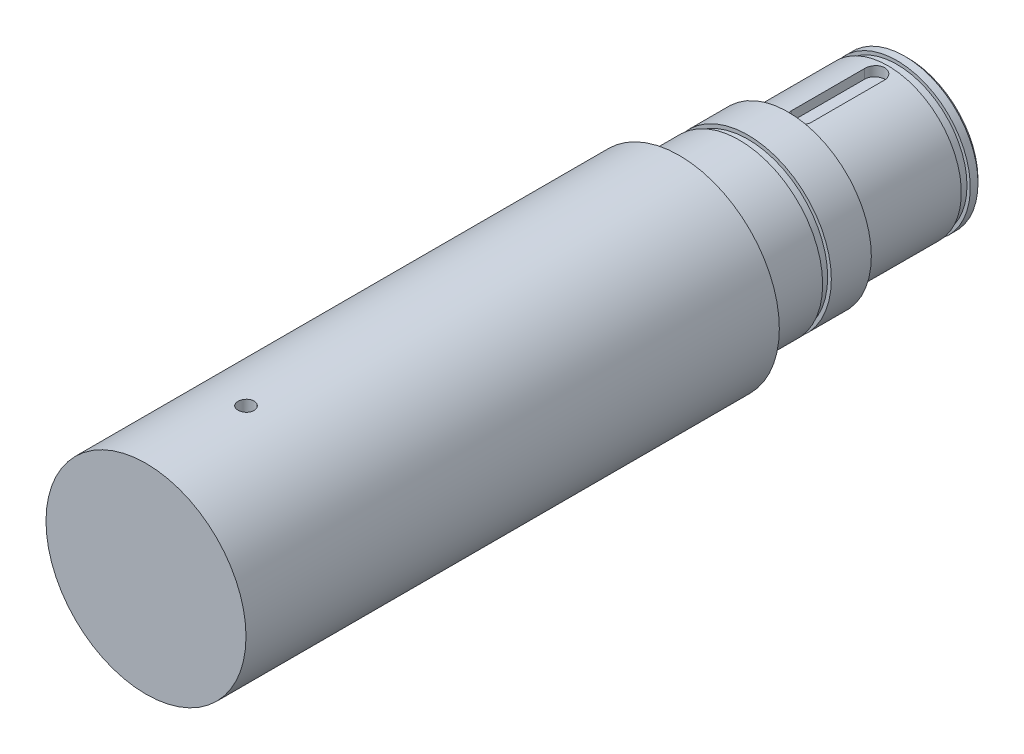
ISO-10303-21;
HEADER;
FILE_DESCRIPTION(('STEP AP214'),'2;1');
FILE_NAME('part.step','',(''),(''),'','','');
FILE_SCHEMA(('AUTOMOTIVE_DESIGN { 1 0 10303 214 1 1 1 1 }'));
ENDSEC;
DATA;
#1=APPLICATION_CONTEXT('core data for automotive mechanical design processes');
#2=APPLICATION_PROTOCOL_DEFINITION('international standard','automotive_design',2000,#1);
#3=PRODUCT_CONTEXT('',#1,'mechanical');
#4=PRODUCT('Part','Part','',(#3));
#5=PRODUCT_RELATED_PRODUCT_CATEGORY('part','',(#4));
#6=PRODUCT_DEFINITION_FORMATION('','',#4);
#7=PRODUCT_DEFINITION_CONTEXT('part definition',#1,'design');
#8=PRODUCT_DEFINITION('design','',#6,#7);
#9=PRODUCT_DEFINITION_SHAPE('','',#8);
#10=(LENGTH_UNIT() NAMED_UNIT(*) SI_UNIT(.MILLI.,.METRE.));
#11=(NAMED_UNIT(*) PLANE_ANGLE_UNIT() SI_UNIT($,.RADIAN.));
#12=(NAMED_UNIT(*) SI_UNIT($,.STERADIAN.) SOLID_ANGLE_UNIT());
#13=UNCERTAINTY_MEASURE_WITH_UNIT(LENGTH_MEASURE(1.E-05),#10,'distance_accuracy_value','');
#14=(GEOMETRIC_REPRESENTATION_CONTEXT(3) GLOBAL_UNCERTAINTY_ASSIGNED_CONTEXT((#13)) GLOBAL_UNIT_ASSIGNED_CONTEXT((#10,
#11,#12)) REPRESENTATION_CONTEXT('',''));
#15=CARTESIAN_POINT('',(0.,0.,0.));
#16=DIRECTION('',(0.,0.,1.));
#17=DIRECTION('',(1.,0.,0.));
#18=AXIS2_PLACEMENT_3D('',#15,#16,#17);
#19=CARTESIAN_POINT('',(0.,0.,18.));
#20=DIRECTION('',(0.,0.,-1.));
#21=DIRECTION('',(-1.,0.,0.));
#22=AXIS2_PLACEMENT_3D('',#19,#20,#21);
#23=CYLINDRICAL_SURFACE('',#22,11.);
#24=DIRECTION('',(0.,0.,-1.));
#25=VECTOR('',#24,1.);
#26=CARTESIAN_POINT('',(-1.5,10.8972473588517,18.));
#27=LINE('',#26,#25);
#28=CARTESIAN_POINT('',(-1.5,10.8972473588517,16.));
#29=VERTEX_POINT('',#28);
#30=CARTESIAN_POINT('',(-1.5,10.8972473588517,5.));
#31=VERTEX_POINT('',#30);
#32=EDGE_CURVE('E45',#29,#31,#27,.T.);
#33=ORIENTED_EDGE('',*,*,#32,.T.);
#34=CARTESIAN_POINT('',(-1.5,10.8972473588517,5.));
#35=CARTESIAN_POINT('',(-1.49999995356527,10.8972459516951,4.958007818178));
#36=CARTESIAN_POINT('',(-1.49823554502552,10.8974903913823,4.91603594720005));
#37=CARTESIAN_POINT('',(-1.49119813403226,10.8984561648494,4.83239641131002));
#38=CARTESIAN_POINT('',(-1.48592542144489,10.8991774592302,4.79072872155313));
#39=CARTESIAN_POINT('',(-1.46490229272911,10.9020307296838,4.66673026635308));
#40=CARTESIAN_POINT('',(-1.44394670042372,10.9048522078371,4.58523622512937));
#41=CARTESIAN_POINT('',(-1.3887651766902,10.9120161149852,4.4269665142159));
#42=CARTESIAN_POINT('',(-1.3545352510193,10.9163590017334,4.35019227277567));
#43=CARTESIAN_POINT('',(-1.27379205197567,10.9260743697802,4.20346904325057));
#44=CARTESIAN_POINT('',(-1.22727946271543,10.9314467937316,4.13351967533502));
#45=CARTESIAN_POINT('',(-1.12296889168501,10.942655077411,4.00198765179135));
#46=CARTESIAN_POINT('',(-1.06510669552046,10.9484934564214,3.94045615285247));
#47=CARTESIAN_POINT('',(-0.939870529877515,10.9599539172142,3.82793762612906));
#48=CARTESIAN_POINT('',(-0.872495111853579,10.9655759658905,3.77695220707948));
#49=CARTESIAN_POINT('',(-0.729821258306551,10.9759960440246,3.68679418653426));
#50=CARTESIAN_POINT('',(-0.654492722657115,10.9807907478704,3.64766880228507));
#51=CARTESIAN_POINT('',(-0.498262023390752,10.9889875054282,3.58264592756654));
#52=CARTESIAN_POINT('',(-0.417360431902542,10.9923897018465,3.55674708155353));
#53=CARTESIAN_POINT('',(-0.252808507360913,10.9974005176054,3.51906519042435));
#54=CARTESIAN_POINT('',(-0.169178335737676,10.9990201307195,3.50719558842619));
#55=CARTESIAN_POINT('',(-0.00109655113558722,11.0003209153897,3.49764056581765));
#56=CARTESIAN_POINT('',(0.0833550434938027,11.0000021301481,3.49995482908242));
#57=CARTESIAN_POINT('',(0.250088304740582,10.9974708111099,3.51863345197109));
#58=CARTESIAN_POINT('',(0.332380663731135,10.9952708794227,3.53490431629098));
#59=CARTESIAN_POINT('',(0.493055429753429,10.9892385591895,3.58088777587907));
#60=CARTESIAN_POINT('',(0.571437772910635,10.9854061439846,3.61060059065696));
#61=CARTESIAN_POINT('',(0.722356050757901,10.9765176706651,3.68272292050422));
#62=CARTESIAN_POINT('',(0.794872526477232,10.9714577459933,3.72517265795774));
#63=CARTESIAN_POINT('',(0.931784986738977,10.9606797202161,3.82153285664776));
#64=CARTESIAN_POINT('',(0.996180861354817,10.9549616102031,3.87544347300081));
#65=CARTESIAN_POINT('',(1.1155695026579,10.9434518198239,3.99370907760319));
#66=CARTESIAN_POINT('',(1.17048285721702,10.9376599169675,4.05814423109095));
#67=CARTESIAN_POINT('',(1.26874438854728,10.92669853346,4.19538205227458));
#68=CARTESIAN_POINT('',(1.31208916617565,10.9215292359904,4.26818717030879));
#69=CARTESIAN_POINT('',(1.38598979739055,10.9123978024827,4.42018409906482));
#70=CARTESIAN_POINT('',(1.41653093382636,10.9084370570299,4.49938313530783));
#71=CARTESIAN_POINT('',(1.46381257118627,10.9021938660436,4.661795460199));
#72=CARTESIAN_POINT('',(1.48057381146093,10.8999088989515,4.74500251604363));
#73=CARTESIAN_POINT('',(1.49347688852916,10.8981434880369,4.85734730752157));
#74=CARTESIAN_POINT('',(1.49592418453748,10.897807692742,4.88584719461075));
#75=CARTESIAN_POINT('',(1.49918356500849,10.8973598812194,4.94289399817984));
#76=CARTESIAN_POINT('',(1.49999839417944,10.8972474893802,4.97144075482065));
#77=CARTESIAN_POINT('',(1.5,10.8972473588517,5.));
#78=B_SPLINE_CURVE_WITH_KNOTS('',3,(#34,#35,#36,#37,#38,#39,#40,#41,#42,#43,#44,#45,#46,#47,#48,
#49,#50,#51,#52,#53,#54,#55,#56,#57,#58,#59,#60,#61,#62,#63,#64,#65,#66,#67,#68,#69,#70,#71,#72,
#73,#74,#75,#76,#77),.UNSPECIFIED.,.F.,.F.,(4,2,2,2,2,2,2,2,2,2,2,2,2,2,2,2,2,2,2,2,2,4),(0.,
0.125898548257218,0.251786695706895,0.503065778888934,0.754420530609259,1.00576128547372,
1.25856739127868,1.51141203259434,1.76525046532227,2.01906287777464,2.2713010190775,
2.52353353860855,2.77408943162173,3.0246494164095,3.27600913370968,3.52737225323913,
3.78074786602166,4.03419784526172,4.28793835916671,4.54129627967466,4.62708158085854,
4.71272252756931),.UNSPECIFIED.);
#79=CARTESIAN_POINT('',(1.5,10.8972473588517,5.));
#80=VERTEX_POINT('',#79);
#81=EDGE_CURVE('E154',#31,#80,#78,.T.);
#82=ORIENTED_EDGE('',*,*,#81,.T.);
#83=DIRECTION('',(0.,0.,-1.));
#84=VECTOR('',#83,1.);
#85=CARTESIAN_POINT('',(1.5,10.8972473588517,18.));
#86=LINE('',#85,#84);
#87=CARTESIAN_POINT('',(1.5,10.8972473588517,16.));
#88=VERTEX_POINT('',#87);
#89=EDGE_CURVE('E379',#80,#88,#86,.F.);
#90=ORIENTED_EDGE('',*,*,#89,.T.);
#91=CARTESIAN_POINT('',(1.5,10.8972473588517,16.));
#92=CARTESIAN_POINT('',(1.49999995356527,10.8972459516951,16.041992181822));
#93=CARTESIAN_POINT('',(1.49823554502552,10.8974903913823,16.0839640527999));
#94=CARTESIAN_POINT('',(1.49119813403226,10.8984561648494,16.16760358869));
#95=CARTESIAN_POINT('',(1.48592542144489,10.8991774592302,16.2092712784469));
#96=CARTESIAN_POINT('',(1.46490229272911,10.9020307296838,16.3332697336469));
#97=CARTESIAN_POINT('',(1.44394670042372,10.9048522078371,16.4147637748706));
#98=CARTESIAN_POINT('',(1.3887651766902,10.9120161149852,16.5730334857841));
#99=CARTESIAN_POINT('',(1.3545352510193,10.9163590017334,16.6498077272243));
#100=CARTESIAN_POINT('',(1.27379205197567,10.9260743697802,16.7965309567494));
#101=CARTESIAN_POINT('',(1.22727946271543,10.9314467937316,16.866480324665));
#102=CARTESIAN_POINT('',(1.12296889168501,10.942655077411,16.9980123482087));
#103=CARTESIAN_POINT('',(1.06510669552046,10.9484934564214,17.0595438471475));
#104=CARTESIAN_POINT('',(0.939870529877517,10.9599539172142,17.1720623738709));
#105=CARTESIAN_POINT('',(0.872495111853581,10.9655759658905,17.2230477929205));
#106=CARTESIAN_POINT('',(0.729821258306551,10.9759960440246,17.3132058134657));
#107=CARTESIAN_POINT('',(0.654492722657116,10.9807907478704,17.3523311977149));
#108=CARTESIAN_POINT('',(0.498262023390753,10.9889875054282,17.4173540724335));
#109=CARTESIAN_POINT('',(0.417360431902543,10.9923897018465,17.4432529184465));
#110=CARTESIAN_POINT('',(0.252808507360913,10.9974005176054,17.4809348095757));
#111=CARTESIAN_POINT('',(0.169178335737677,10.9990201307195,17.4928044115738));
#112=CARTESIAN_POINT('',(0.00109655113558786,11.0003209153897,17.5023594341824));
#113=CARTESIAN_POINT('',(-0.0833550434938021,11.0000021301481,17.5000451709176));
#114=CARTESIAN_POINT('',(-0.250088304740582,10.9974708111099,17.4813665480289));
#115=CARTESIAN_POINT('',(-0.332380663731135,10.9952708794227,17.465095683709));
#116=CARTESIAN_POINT('',(-0.493055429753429,10.9892385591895,17.4191122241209));
#117=CARTESIAN_POINT('',(-0.571437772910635,10.9854061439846,17.389399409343));
#118=CARTESIAN_POINT('',(-0.722356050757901,10.9765176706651,17.3172770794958));
#119=CARTESIAN_POINT('',(-0.794872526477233,10.9714577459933,17.2748273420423));
#120=CARTESIAN_POINT('',(-0.931784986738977,10.9606797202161,17.1784671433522));
#121=CARTESIAN_POINT('',(-0.996180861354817,10.9549616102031,17.1245565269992));
#122=CARTESIAN_POINT('',(-1.1155695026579,10.9434518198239,17.0062909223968));
#123=CARTESIAN_POINT('',(-1.17048285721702,10.9376599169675,16.9418557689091));
#124=CARTESIAN_POINT('',(-1.26874438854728,10.92669853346,16.8046179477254));
#125=CARTESIAN_POINT('',(-1.31208916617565,10.9215292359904,16.7318128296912));
#126=CARTESIAN_POINT('',(-1.38598979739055,10.9123978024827,16.5798159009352));
#127=CARTESIAN_POINT('',(-1.41653093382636,10.9084370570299,16.5006168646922));
#128=CARTESIAN_POINT('',(-1.46381257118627,10.9021938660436,16.338204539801));
#129=CARTESIAN_POINT('',(-1.48057381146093,10.8999088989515,16.2549974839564));
#130=CARTESIAN_POINT('',(-1.49347688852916,10.8981434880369,16.1426526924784));
#131=CARTESIAN_POINT('',(-1.49592418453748,10.897807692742,16.1141528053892));
#132=CARTESIAN_POINT('',(-1.49918356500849,10.8973598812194,16.0571060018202));
#133=CARTESIAN_POINT('',(-1.49999839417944,10.8972474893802,16.0285592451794));
#134=CARTESIAN_POINT('',(-1.5,10.8972473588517,16.));
#135=B_SPLINE_CURVE_WITH_KNOTS('',3,(#91,#92,#93,#94,#95,#96,#97,#98,#99,#100,#101,#102,#103,
#104,#105,#106,#107,#108,#109,#110,#111,#112,#113,#114,#115,#116,#117,#118,#119,#120,#121,#122,
#123,#124,#125,#126,#127,#128,#129,#130,#131,#132,#133,#134),.UNSPECIFIED.,.F.,.F.,(4,2,2,2,2,2,
2,2,2,2,2,2,2,2,2,2,2,2,2,2,2,4),(0.,0.125898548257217,0.251786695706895,0.503065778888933,
0.754420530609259,1.00576128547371,1.25856739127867,1.51141203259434,1.76525046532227,
2.01906287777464,2.27130101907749,2.52353353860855,2.77408943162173,3.0246494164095,
3.27600913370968,3.52737225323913,3.78074786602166,4.03419784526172,4.28793835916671,
4.54129627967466,4.62708158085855,4.71272252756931),.UNSPECIFIED.);
#136=EDGE_CURVE('E52',#88,#29,#135,.T.);
#137=ORIENTED_EDGE('',*,*,#136,.T.);
#138=EDGE_LOOP('',(#33,#82,#90,#137));
#139=FACE_BOUND('',#138,.T.);
#140=CARTESIAN_POINT('',(0.,0.,18.));
#141=DIRECTION('',(0.,0.,1.));
#142=DIRECTION('',(1.,0.,0.));
#143=AXIS2_PLACEMENT_3D('',#140,#141,#142);
#144=CIRCLE('',#143,11.);
#145=CARTESIAN_POINT('',(11.,0.,18.));
#146=VERTEX_POINT('',#145);
#147=EDGE_CURVE('E139',#146,#146,#144,.T.);
#148=ORIENTED_EDGE('',*,*,#147,.F.);
#149=EDGE_LOOP('',(#148));
#150=FACE_BOUND('',#149,.T.);
#151=CARTESIAN_POINT('',(0.,0.,3.));
#152=DIRECTION('',(0.,0.,-1.));
#153=DIRECTION('',(-1.,0.,0.));
#154=AXIS2_PLACEMENT_3D('',#151,#152,#153);
#155=CIRCLE('',#154,11.);
#156=CARTESIAN_POINT('',(-11.,0.,3.));
#157=VERTEX_POINT('',#156);
#158=EDGE_CURVE('E113',#157,#157,#155,.T.);
#159=ORIENTED_EDGE('',*,*,#158,.F.);
#160=EDGE_LOOP('',(#159));
#161=FACE_BOUND('',#160,.T.);
#162=ADVANCED_FACE('F33',(#139,#150,#161),#23,.T.);
#163=CARTESIAN_POINT('',(0.,0.,24.));
#164=DIRECTION('',(0.,0.,1.));
#165=DIRECTION('',(1.,0.,0.));
#166=AXIS2_PLACEMENT_3D('',#163,#164,#165);
#167=PLANE('',#166);
#168=CARTESIAN_POINT('',(0.,0.,24.));
#169=DIRECTION('',(0.,0.,1.));
#170=DIRECTION('',(1.,0.,0.));
#171=AXIS2_PLACEMENT_3D('',#168,#169,#170);
#172=CIRCLE('',#171,12.5);
#173=CARTESIAN_POINT('',(12.5,0.,24.));
#174=VERTEX_POINT('',#173);
#175=EDGE_CURVE('E136',#174,#174,#172,.T.);
#176=ORIENTED_EDGE('',*,*,#175,.T.);
#177=EDGE_LOOP('',(#176));
#178=FACE_BOUND('',#177,.T.);
#179=CARTESIAN_POINT('',(0.,0.,24.));
#180=DIRECTION('',(0.,0.,1.));
#181=DIRECTION('',(1.,0.,0.));
#182=AXIS2_PLACEMENT_3D('',#179,#180,#181);
#183=CIRCLE('',#182,11.95);
#184=CARTESIAN_POINT('',(11.95,0.,24.));
#185=VERTEX_POINT('',#184);
#186=EDGE_CURVE('E127',#185,#185,#183,.T.);
#187=ORIENTED_EDGE('',*,*,#186,.F.);
#188=EDGE_LOOP('',(#187));
#189=FACE_BOUND('',#188,.T.);
#190=ADVANCED_FACE('F222',(#178,#189),#167,.T.);
#191=CARTESIAN_POINT('',(0.,0.,18.));
#192=DIRECTION('',(0.,0.,1.));
#193=DIRECTION('',(1.,0.,0.));
#194=AXIS2_PLACEMENT_3D('',#191,#192,#193);
#195=PLANE('',#194);
#196=CARTESIAN_POINT('',(0.,0.,18.));
#197=DIRECTION('',(0.,0.,1.));
#198=DIRECTION('',(1.,0.,0.));
#199=AXIS2_PLACEMENT_3D('',#196,#197,#198);
#200=CIRCLE('',#199,12.5);
#201=CARTESIAN_POINT('',(12.5,0.,18.));
#202=VERTEX_POINT('',#201);
#203=EDGE_CURVE('E133',#202,#202,#200,.T.);
#204=ORIENTED_EDGE('',*,*,#203,.F.);
#205=EDGE_LOOP('',(#204));
#206=FACE_BOUND('',#205,.T.);
#207=ORIENTED_EDGE('',*,*,#147,.T.);
#208=EDGE_LOOP('',(#207));
#209=FACE_BOUND('',#208,.T.);
#210=ADVANCED_FACE('F227',(#206,#209),#195,.F.);
#211=CARTESIAN_POINT('',(0.,0.,24.));
#212=DIRECTION('',(0.,0.,-1.));
#213=DIRECTION('',(-1.,0.,0.));
#214=AXIS2_PLACEMENT_3D('',#211,#212,#213);
#215=CYLINDRICAL_SURFACE('',#214,12.5);
#216=ORIENTED_EDGE('',*,*,#175,.F.);
#217=EDGE_LOOP('',(#216));
#218=FACE_BOUND('',#217,.T.);
#219=ORIENTED_EDGE('',*,*,#203,.T.);
#220=EDGE_LOOP('',(#219));
#221=FACE_BOUND('',#220,.T.);
#222=ADVANCED_FACE('F247',(#218,#221),#215,.T.);
#223=CARTESIAN_POINT('',(0.,0.,25.3));
#224=DIRECTION('',(0.,0.,-1.));
#225=DIRECTION('',(-1.,0.,0.));
#226=AXIS2_PLACEMENT_3D('',#223,#224,#225);
#227=CYLINDRICAL_SURFACE('',#226,11.95);
#228=CARTESIAN_POINT('',(0.,0.,25.3));
#229=DIRECTION('',(0.,0.,1.));
#230=DIRECTION('',(1.,0.,0.));
#231=AXIS2_PLACEMENT_3D('',#228,#229,#230);
#232=CIRCLE('',#231,11.95);
#233=CARTESIAN_POINT('',(11.95,0.,25.3));
#234=VERTEX_POINT('',#233);
#235=EDGE_CURVE('E130',#234,#234,#232,.T.);
#236=ORIENTED_EDGE('',*,*,#235,.F.);
#237=EDGE_LOOP('',(#236));
#238=FACE_BOUND('',#237,.T.);
#239=ORIENTED_EDGE('',*,*,#186,.T.);
#240=EDGE_LOOP('',(#239));
#241=FACE_BOUND('',#240,.T.);
#242=ADVANCED_FACE('F250',(#238,#241),#227,.T.);
#243=CARTESIAN_POINT('',(0.,0.,25.3));
#244=DIRECTION('',(0.,0.,1.));
#245=DIRECTION('',(1.,0.,0.));
#246=AXIS2_PLACEMENT_3D('',#243,#244,#245);
#247=PLANE('',#246);
#248=CARTESIAN_POINT('',(0.,0.,25.3));
#249=DIRECTION('',(0.,0.,1.));
#250=DIRECTION('',(1.,0.,0.));
#251=AXIS2_PLACEMENT_3D('',#248,#249,#250);
#252=CIRCLE('',#251,12.5);
#253=CARTESIAN_POINT('',(12.5,0.,25.3));
#254=VERTEX_POINT('',#253);
#255=EDGE_CURVE('E119',#254,#254,#252,.T.);
#256=ORIENTED_EDGE('',*,*,#255,.F.);
#257=EDGE_LOOP('',(#256));
#258=FACE_BOUND('',#257,.T.);
#259=ORIENTED_EDGE('',*,*,#235,.T.);
#260=EDGE_LOOP('',(#259));
#261=FACE_BOUND('',#260,.T.);
#262=ADVANCED_FACE('F207',(#258,#261),#247,.F.);
#263=CARTESIAN_POINT('',(0.,0.,34.3));
#264=DIRECTION('',(0.,0.,-1.));
#265=DIRECTION('',(-1.,0.,0.));
#266=AXIS2_PLACEMENT_3D('',#263,#264,#265);
#267=CYLINDRICAL_SURFACE('',#266,12.5);
#268=CARTESIAN_POINT('',(0.,0.,34.3));
#269=DIRECTION('',(0.,0.,1.));
#270=DIRECTION('',(1.,0.,0.));
#271=AXIS2_PLACEMENT_3D('',#268,#269,#270);
#272=CIRCLE('',#271,12.5);
#273=CARTESIAN_POINT('',(12.5,0.,34.3));
#274=VERTEX_POINT('',#273);
#275=EDGE_CURVE('E124',#274,#274,#272,.T.);
#276=ORIENTED_EDGE('',*,*,#275,.F.);
#277=EDGE_LOOP('',(#276));
#278=FACE_BOUND('',#277,.T.);
#279=ORIENTED_EDGE('',*,*,#255,.T.);
#280=EDGE_LOOP('',(#279));
#281=FACE_BOUND('',#280,.T.);
#282=ADVANCED_FACE('F201',(#278,#281),#267,.T.);
#283=CARTESIAN_POINT('',(0.,0.,34.3));
#284=DIRECTION('',(0.,0.,1.));
#285=DIRECTION('',(1.,0.,0.));
#286=AXIS2_PLACEMENT_3D('',#283,#284,#285);
#287=PLANE('',#286);
#288=CARTESIAN_POINT('',(0.,0.,34.3));
#289=DIRECTION('',(0.,0.,1.));
#290=DIRECTION('',(1.,0.,0.));
#291=AXIS2_PLACEMENT_3D('',#288,#289,#290);
#292=CIRCLE('',#291,15.);
#293=CARTESIAN_POINT('',(15.,0.,34.3));
#294=VERTEX_POINT('',#293);
#295=EDGE_CURVE('E120',#294,#294,#292,.T.);
#296=ORIENTED_EDGE('',*,*,#295,.F.);
#297=EDGE_LOOP('',(#296));
#298=FACE_BOUND('',#297,.T.);
#299=ORIENTED_EDGE('',*,*,#275,.T.);
#300=EDGE_LOOP('',(#299));
#301=FACE_BOUND('',#300,.T.);
#302=ADVANCED_FACE('F199',(#298,#301),#287,.F.);
#303=CARTESIAN_POINT('',(0.,0.,114.3));
#304=DIRECTION('',(0.,0.,-1.));
#305=DIRECTION('',(-1.,0.,0.));
#306=AXIS2_PLACEMENT_3D('',#303,#304,#305);
#307=CYLINDRICAL_SURFACE('',#306,15.);
#308=CARTESIAN_POINT('',(0.,15.,100.5));
#309=CARTESIAN_POINT('',(-0.0672891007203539,14.9999993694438,100.499997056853));
#310=CARTESIAN_POINT('',(-0.134624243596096,14.9995423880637,100.494321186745));
#311=CARTESIAN_POINT('',(-0.267432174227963,14.9977633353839,100.471762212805));
#312=CARTESIAN_POINT('',(-0.332902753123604,14.9964402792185,100.454866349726));
#313=CARTESIAN_POINT('',(-0.460038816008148,14.9930786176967,100.410358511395));
#314=CARTESIAN_POINT('',(-0.521706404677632,14.991040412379,100.382752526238));
#315=CARTESIAN_POINT('',(-0.639517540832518,14.9864771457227,100.317618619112));
#316=CARTESIAN_POINT('',(-0.695662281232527,14.9839521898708,100.280092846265));
#317=CARTESIAN_POINT('',(-0.800981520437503,14.9786921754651,100.196088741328));
#318=CARTESIAN_POINT('',(-0.850141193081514,14.975956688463,100.149591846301));
#319=CARTESIAN_POINT('',(-0.939967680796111,14.9705875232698,100.049004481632));
#320=CARTESIAN_POINT('',(-0.980634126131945,14.9679538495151,99.9949136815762));
#321=CARTESIAN_POINT('',(-1.05236939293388,14.9630818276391,99.8805849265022));
#322=CARTESIAN_POINT('',(-1.08342527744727,14.9608440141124,99.8203388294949));
#323=CARTESIAN_POINT('',(-1.13497520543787,14.9570218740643,99.6954664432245));
#324=CARTESIAN_POINT('',(-1.15546942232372,14.9554375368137,99.6308402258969));
#325=CARTESIAN_POINT('',(-1.18527149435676,14.9531052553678,99.4991899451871));
#326=CARTESIAN_POINT('',(-1.19460338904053,14.9523555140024,99.4321713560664));
#327=CARTESIAN_POINT('',(-1.20189017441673,14.9517716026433,99.2975151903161));
#328=CARTESIAN_POINT('',(-1.19984526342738,14.9519374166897,99.2298776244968));
#329=CARTESIAN_POINT('',(-1.18445636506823,14.9531642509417,99.0960680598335));
#330=CARTESIAN_POINT('',(-1.1711384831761,14.9542232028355,99.029893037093));
#331=CARTESIAN_POINT('',(-1.13362223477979,14.9571137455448,98.9007206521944));
#332=CARTESIAN_POINT('',(-1.10942376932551,14.9589453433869,98.8377233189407));
#333=CARTESIAN_POINT('',(-1.05080395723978,14.9631771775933,98.7166112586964));
#334=CARTESIAN_POINT('',(-1.01637087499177,14.9655780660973,98.6585022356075));
#335=CARTESIAN_POINT('',(-0.93826772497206,14.9706773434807,98.5488786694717));
#336=CARTESIAN_POINT('',(-0.894597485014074,14.9733757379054,98.4973642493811));
#337=CARTESIAN_POINT('',(-0.799113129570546,14.9787751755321,98.4022403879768));
#338=CARTESIAN_POINT('',(-0.747276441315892,14.9814762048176,98.35865360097));
#339=CARTESIAN_POINT('',(-0.637009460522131,14.986569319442,98.2807973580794));
#340=CARTESIAN_POINT('',(-0.578579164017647,14.9889614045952,98.246527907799));
#341=CARTESIAN_POINT('',(-0.456769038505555,14.9931675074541,98.1882806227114));
#342=CARTESIAN_POINT('',(-0.393388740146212,14.9949814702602,98.164303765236));
#343=CARTESIAN_POINT('',(-0.263484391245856,14.9978262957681,98.1273380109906));
#344=CARTESIAN_POINT('',(-0.196960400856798,14.9988571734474,98.1143489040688));
#345=CARTESIAN_POINT('',(-0.0628534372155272,15.0000177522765,98.0997557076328));
#346=CARTESIAN_POINT('',(0.0047261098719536,15.0001499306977,98.0981203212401));
#347=CARTESIAN_POINT('',(0.139198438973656,14.9995048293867,98.1061990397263));
#348=CARTESIAN_POINT('',(0.206091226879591,14.9987275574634,98.1159130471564));
#349=CARTESIAN_POINT('',(0.337202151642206,14.9963525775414,98.1463888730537));
#350=CARTESIAN_POINT('',(0.401423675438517,14.9947559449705,98.167136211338));
#351=CARTESIAN_POINT('',(0.525473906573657,14.9909216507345,98.2190749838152));
#352=CARTESIAN_POINT('',(0.585302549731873,14.9886839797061,98.2502665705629));
#353=CARTESIAN_POINT('',(0.699011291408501,14.9838123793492,98.3222872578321));
#354=CARTESIAN_POINT('',(0.752878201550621,14.9811776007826,98.3631371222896));
#355=CARTESIAN_POINT('',(0.853001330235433,14.9758107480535,98.4532847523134));
#356=CARTESIAN_POINT('',(0.899257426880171,14.9730786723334,98.5025826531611));
#357=CARTESIAN_POINT('',(0.98295300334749,14.9678178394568,98.6083626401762));
#358=CARTESIAN_POINT('',(1.02037208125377,14.9652895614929,98.6648608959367));
#359=CARTESIAN_POINT('',(1.0851916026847,14.9607292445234,98.7833571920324));
#360=CARTESIAN_POINT('',(1.11259213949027,14.9586972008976,98.8453551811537));
#361=CARTESIAN_POINT('',(1.15656192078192,14.9553620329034,98.9730184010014));
#362=CARTESIAN_POINT('',(1.17314371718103,14.9540580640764,99.0386792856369));
#363=CARTESIAN_POINT('',(1.19504621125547,14.9523238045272,99.1718640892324));
#364=CARTESIAN_POINT('',(1.20036710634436,14.951893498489,99.2393879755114));
#365=CARTESIAN_POINT('',(1.19959455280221,14.9519554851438,99.3741792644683));
#366=CARTESIAN_POINT('',(1.19353316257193,14.9524451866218,99.4414468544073));
#367=CARTESIAN_POINT('',(1.17023487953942,14.9542865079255,99.5740054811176));
#368=CARTESIAN_POINT('',(1.15299796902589,14.9556381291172,99.6392965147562));
#369=CARTESIAN_POINT('',(1.10784591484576,14.9590503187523,99.7660511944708));
#370=CARTESIAN_POINT('',(1.07993127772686,14.9611108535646,99.8275150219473));
#371=CARTESIAN_POINT('',(1.01421985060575,14.965708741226,99.9448889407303));
#372=CARTESIAN_POINT('',(0.976423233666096,14.9682460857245,100.000799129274));
#373=CARTESIAN_POINT('',(0.891900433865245,14.9735201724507,100.105642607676));
#374=CARTESIAN_POINT('',(0.845150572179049,14.9762574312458,100.154556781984));
#375=CARTESIAN_POINT('',(0.744090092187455,14.9816182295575,100.243863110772));
#376=CARTESIAN_POINT('',(0.689777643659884,14.9842417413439,100.284253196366));
#377=CARTESIAN_POINT('',(0.575036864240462,14.9890838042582,100.35541449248));
#378=CARTESIAN_POINT('',(0.514598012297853,14.9913016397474,100.386168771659));
#379=CARTESIAN_POINT('',(0.389438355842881,14.9950739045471,100.437053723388));
#380=CARTESIAN_POINT('',(0.324722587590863,14.9966290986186,100.457196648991));
#381=CARTESIAN_POINT('',(0.216352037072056,14.9985001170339,100.481138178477));
#382=CARTESIAN_POINT('',(0.173394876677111,14.9990600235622,100.488202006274));
#383=CARTESIAN_POINT('',(0.0869648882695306,14.9998101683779,100.497633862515));
#384=CARTESIAN_POINT('',(0.043492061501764,15.0000004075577,100.500001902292));
#385=CARTESIAN_POINT('',(0.,15.,100.5));
#386=B_SPLINE_CURVE_WITH_KNOTS('',3,(#308,#309,#310,#311,#312,#313,#314,#315,#316,#317,#318,
#319,#320,#321,#322,#323,#324,#325,#326,#327,#328,#329,#330,#331,#332,#333,#334,#335,#336,#337,
#338,#339,#340,#341,#342,#343,#344,#345,#346,#347,#348,#349,#350,#351,#352,#353,#354,#355,#356,
#357,#358,#359,#360,#361,#362,#363,#364,#365,#366,#367,#368,#369,#370,#371,#372,#373,#374,#375,
#376,#377,#378,#379,#380,#381,#382,#383,#384,#385),.UNSPECIFIED.,.T.,.F.,(4,2,2,2,2,2,2,2,2,2,2,
2,2,2,2,2,2,2,2,2,2,2,2,2,2,2,2,2,2,2,2,2,2,2,2,2,2,2,4),(0.,0.201708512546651,0.40364679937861,
0.605472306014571,0.807254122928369,1.00945803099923,1.21167073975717,1.41415447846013,
1.6166348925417,1.81867844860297,2.02071848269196,2.22229191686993,2.423867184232,
2.62567448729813,2.82748555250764,3.0298645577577,3.23224368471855,3.4346420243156,
3.63703649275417,3.83887283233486,4.04070743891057,4.24227780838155,4.44385112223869,
4.64586179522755,4.84787570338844,5.05035153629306,5.25282548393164,5.45506410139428,
5.65729917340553,5.85896550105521,6.06063214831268,6.26228922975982,6.46394277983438,
6.66613720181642,6.86838064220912,7.07097748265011,7.27333986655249,7.40371373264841,
7.53408728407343),.UNSPECIFIED.);
#387=CARTESIAN_POINT('',(0.,15.,100.5));
#388=VERTEX_POINT('',#387);
#389=EDGE_CURVE('E12',#388,#388,#386,.T.);
#390=ORIENTED_EDGE('',*,*,#389,.T.);
#391=EDGE_LOOP('',(#390));
#392=FACE_BOUND('',#391,.T.);
#393=CARTESIAN_POINT('',(0.,-15.,100.5));
#394=CARTESIAN_POINT('',(0.0672891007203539,-14.9999993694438,100.499997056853));
#395=CARTESIAN_POINT('',(0.134624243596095,-14.9995423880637,100.494321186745));
#396=CARTESIAN_POINT('',(0.267432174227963,-14.9977633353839,100.471762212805));
#397=CARTESIAN_POINT('',(0.332902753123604,-14.9964402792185,100.454866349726));
#398=CARTESIAN_POINT('',(0.460038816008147,-14.9930786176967,100.410358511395));
#399=CARTESIAN_POINT('',(0.521706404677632,-14.991040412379,100.382752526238));
#400=CARTESIAN_POINT('',(0.639517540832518,-14.9864771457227,100.317618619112));
#401=CARTESIAN_POINT('',(0.695662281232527,-14.9839521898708,100.280092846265));
#402=CARTESIAN_POINT('',(0.800981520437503,-14.9786921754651,100.196088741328));
#403=CARTESIAN_POINT('',(0.850141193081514,-14.975956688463,100.149591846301));
#404=CARTESIAN_POINT('',(0.939967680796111,-14.9705875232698,100.049004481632));
#405=CARTESIAN_POINT('',(0.980634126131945,-14.9679538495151,99.9949136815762));
#406=CARTESIAN_POINT('',(1.05236939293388,-14.9630818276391,99.8805849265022));
#407=CARTESIAN_POINT('',(1.08342527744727,-14.9608440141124,99.8203388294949));
#408=CARTESIAN_POINT('',(1.13497520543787,-14.9570218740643,99.6954664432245));
#409=CARTESIAN_POINT('',(1.15546942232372,-14.9554375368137,99.6308402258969));
#410=CARTESIAN_POINT('',(1.18527149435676,-14.9531052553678,99.4991899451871));
#411=CARTESIAN_POINT('',(1.19460338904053,-14.9523555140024,99.4321713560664));
#412=CARTESIAN_POINT('',(1.20189017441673,-14.9517716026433,99.2975151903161));
#413=CARTESIAN_POINT('',(1.19984526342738,-14.9519374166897,99.2298776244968));
#414=CARTESIAN_POINT('',(1.18445636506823,-14.9531642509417,99.0960680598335));
#415=CARTESIAN_POINT('',(1.1711384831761,-14.9542232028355,99.029893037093));
#416=CARTESIAN_POINT('',(1.13362223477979,-14.9571137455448,98.9007206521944));
#417=CARTESIAN_POINT('',(1.10942376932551,-14.9589453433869,98.8377233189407));
#418=CARTESIAN_POINT('',(1.05080395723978,-14.9631771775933,98.7166112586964));
#419=CARTESIAN_POINT('',(1.01637087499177,-14.9655780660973,98.6585022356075));
#420=CARTESIAN_POINT('',(0.93826772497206,-14.9706773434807,98.5488786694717));
#421=CARTESIAN_POINT('',(0.894597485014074,-14.9733757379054,98.4973642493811));
#422=CARTESIAN_POINT('',(0.799113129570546,-14.9787751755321,98.4022403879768));
#423=CARTESIAN_POINT('',(0.747276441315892,-14.9814762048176,98.35865360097));
#424=CARTESIAN_POINT('',(0.637009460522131,-14.986569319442,98.2807973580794));
#425=CARTESIAN_POINT('',(0.578579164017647,-14.9889614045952,98.246527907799));
#426=CARTESIAN_POINT('',(0.456769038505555,-14.9931675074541,98.1882806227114));
#427=CARTESIAN_POINT('',(0.393388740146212,-14.9949814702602,98.164303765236));
#428=CARTESIAN_POINT('',(0.263484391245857,-14.9978262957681,98.1273380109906));
#429=CARTESIAN_POINT('',(0.196960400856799,-14.9988571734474,98.1143489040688));
#430=CARTESIAN_POINT('',(0.0628534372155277,-15.0000177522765,98.0997557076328));
#431=CARTESIAN_POINT('',(-0.00472610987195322,-15.0001499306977,98.0981203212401));
#432=CARTESIAN_POINT('',(-0.139198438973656,-14.9995048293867,98.1061990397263));
#433=CARTESIAN_POINT('',(-0.206091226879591,-14.9987275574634,98.1159130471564));
#434=CARTESIAN_POINT('',(-0.337202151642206,-14.9963525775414,98.1463888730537));
#435=CARTESIAN_POINT('',(-0.401423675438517,-14.9947559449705,98.167136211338));
#436=CARTESIAN_POINT('',(-0.525473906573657,-14.9909216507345,98.2190749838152));
#437=CARTESIAN_POINT('',(-0.585302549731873,-14.9886839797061,98.2502665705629));
#438=CARTESIAN_POINT('',(-0.699011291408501,-14.9838123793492,98.3222872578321));
#439=CARTESIAN_POINT('',(-0.752878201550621,-14.9811776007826,98.3631371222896));
#440=CARTESIAN_POINT('',(-0.853001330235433,-14.9758107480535,98.4532847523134));
#441=CARTESIAN_POINT('',(-0.899257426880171,-14.9730786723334,98.5025826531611));
#442=CARTESIAN_POINT('',(-0.98295300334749,-14.9678178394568,98.6083626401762));
#443=CARTESIAN_POINT('',(-1.02037208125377,-14.9652895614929,98.6648608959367));
#444=CARTESIAN_POINT('',(-1.0851916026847,-14.9607292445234,98.7833571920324));
#445=CARTESIAN_POINT('',(-1.11259213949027,-14.9586972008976,98.8453551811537));
#446=CARTESIAN_POINT('',(-1.15656192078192,-14.9553620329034,98.9730184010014));
#447=CARTESIAN_POINT('',(-1.17314371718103,-14.9540580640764,99.0386792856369));
#448=CARTESIAN_POINT('',(-1.19504621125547,-14.9523238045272,99.1718640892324));
#449=CARTESIAN_POINT('',(-1.20036710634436,-14.951893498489,99.2393879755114));
#450=CARTESIAN_POINT('',(-1.19959455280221,-14.9519554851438,99.3741792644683));
#451=CARTESIAN_POINT('',(-1.19353316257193,-14.9524451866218,99.4414468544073));
#452=CARTESIAN_POINT('',(-1.17023487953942,-14.9542865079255,99.5740054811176));
#453=CARTESIAN_POINT('',(-1.15299796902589,-14.9556381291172,99.6392965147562));
#454=CARTESIAN_POINT('',(-1.10784591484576,-14.9590503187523,99.7660511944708));
#455=CARTESIAN_POINT('',(-1.07993127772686,-14.9611108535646,99.8275150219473));
#456=CARTESIAN_POINT('',(-1.01421985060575,-14.965708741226,99.9448889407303));
#457=CARTESIAN_POINT('',(-0.976423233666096,-14.9682460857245,100.000799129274));
#458=CARTESIAN_POINT('',(-0.891900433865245,-14.9735201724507,100.105642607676));
#459=CARTESIAN_POINT('',(-0.845150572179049,-14.9762574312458,100.154556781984));
#460=CARTESIAN_POINT('',(-0.744090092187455,-14.9816182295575,100.243863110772));
#461=CARTESIAN_POINT('',(-0.689777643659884,-14.9842417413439,100.284253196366));
#462=CARTESIAN_POINT('',(-0.575036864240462,-14.9890838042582,100.35541449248));
#463=CARTESIAN_POINT('',(-0.514598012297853,-14.9913016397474,100.386168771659));
#464=CARTESIAN_POINT('',(-0.389438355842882,-14.9950739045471,100.437053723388));
#465=CARTESIAN_POINT('',(-0.324722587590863,-14.9966290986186,100.457196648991));
#466=CARTESIAN_POINT('',(-0.216352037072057,-14.9985001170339,100.481138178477));
#467=CARTESIAN_POINT('',(-0.173394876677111,-14.9990600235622,100.488202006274));
#468=CARTESIAN_POINT('',(-0.0869648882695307,-14.9998101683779,100.497633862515));
#469=CARTESIAN_POINT('',(-0.0434920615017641,-15.0000004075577,100.500001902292));
#470=CARTESIAN_POINT('',(0.,-15.,100.5));
#471=B_SPLINE_CURVE_WITH_KNOTS('',3,(#393,#394,#395,#396,#397,#398,#399,#400,#401,#402,#403,
#404,#405,#406,#407,#408,#409,#410,#411,#412,#413,#414,#415,#416,#417,#418,#419,#420,#421,#422,
#423,#424,#425,#426,#427,#428,#429,#430,#431,#432,#433,#434,#435,#436,#437,#438,#439,#440,#441,
#442,#443,#444,#445,#446,#447,#448,#449,#450,#451,#452,#453,#454,#455,#456,#457,#458,#459,#460,
#461,#462,#463,#464,#465,#466,#467,#468,#469,#470),.UNSPECIFIED.,.T.,.F.,(4,2,2,2,2,2,2,2,2,2,2,
2,2,2,2,2,2,2,2,2,2,2,2,2,2,2,2,2,2,2,2,2,2,2,2,2,2,2,4),(0.,0.201708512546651,0.40364679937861,
0.605472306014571,0.807254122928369,1.00945803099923,1.21167073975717,1.41415447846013,
1.6166348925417,1.81867844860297,2.02071848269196,2.22229191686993,2.423867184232,
2.62567448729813,2.82748555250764,3.0298645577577,3.23224368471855,3.4346420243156,
3.63703649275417,3.83887283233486,4.04070743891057,4.24227780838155,4.44385112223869,
4.64586179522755,4.84787570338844,5.05035153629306,5.25282548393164,5.45506410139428,
5.65729917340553,5.85896550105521,6.06063214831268,6.26228922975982,6.46394277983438,
6.66613720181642,6.86838064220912,7.07097748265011,7.27333986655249,7.40371373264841,
7.53408728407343),.UNSPECIFIED.);
#472=CARTESIAN_POINT('',(0.,-15.,100.5));
#473=VERTEX_POINT('',#472);
#474=EDGE_CURVE('E98',#473,#473,#471,.T.);
#475=ORIENTED_EDGE('',*,*,#474,.T.);
#476=EDGE_LOOP('',(#475));
#477=FACE_BOUND('',#476,.T.);
#478=CARTESIAN_POINT('',(0.,0.,114.3));
#479=DIRECTION('',(0.,0.,1.));
#480=DIRECTION('',(1.,0.,0.));
#481=AXIS2_PLACEMENT_3D('',#478,#479,#480);
#482=CIRCLE('',#481,15.);
#483=CARTESIAN_POINT('',(15.,0.,114.3));
#484=VERTEX_POINT('',#483);
#485=EDGE_CURVE('E116',#484,#484,#482,.T.);
#486=ORIENTED_EDGE('',*,*,#485,.F.);
#487=EDGE_LOOP('',(#486));
#488=FACE_BOUND('',#487,.T.);
#489=ORIENTED_EDGE('',*,*,#295,.T.);
#490=EDGE_LOOP('',(#489));
#491=FACE_BOUND('',#490,.T.);
#492=ADVANCED_FACE('F197',(#392,#477,#488,#491),#307,.T.);
#493=CARTESIAN_POINT('',(0.,0.,114.3));
#494=DIRECTION('',(0.,0.,1.));
#495=DIRECTION('',(1.,0.,0.));
#496=AXIS2_PLACEMENT_3D('',#493,#494,#495);
#497=PLANE('',#496);
#498=ORIENTED_EDGE('',*,*,#485,.T.);
#499=EDGE_LOOP('',(#498));
#500=FACE_BOUND('',#499,.T.);
#501=ADVANCED_FACE('F190',(#500),#497,.T.);
#502=CARTESIAN_POINT('',(0.,0.,1.65));
#503=DIRECTION('',(0.,0.,-1.));
#504=DIRECTION('',(-1.,0.,0.));
#505=AXIS2_PLACEMENT_3D('',#502,#503,#504);
#506=PLANE('',#505);
#507=CARTESIAN_POINT('',(0.,0.,1.65));
#508=DIRECTION('',(0.,0.,-1.));
#509=DIRECTION('',(-1.,0.,0.));
#510=AXIS2_PLACEMENT_3D('',#507,#508,#509);
#511=CIRCLE('',#510,10.5);
#512=CARTESIAN_POINT('',(10.5,0.,1.65));
#513=VERTEX_POINT('',#512);
#514=EDGE_CURVE('E110',#513,#513,#511,.T.);
#515=ORIENTED_EDGE('',*,*,#514,.T.);
#516=EDGE_LOOP('',(#515));
#517=FACE_BOUND('',#516,.T.);
#518=CARTESIAN_POINT('',(0.,0.,1.65));
#519=DIRECTION('',(0.,0.,-1.));
#520=DIRECTION('',(-1.,0.,0.));
#521=AXIS2_PLACEMENT_3D('',#518,#519,#520);
#522=CIRCLE('',#521,11.);
#523=CARTESIAN_POINT('',(-11.,0.,1.65));
#524=VERTEX_POINT('',#523);
#525=EDGE_CURVE('E123',#524,#524,#522,.T.);
#526=ORIENTED_EDGE('',*,*,#525,.F.);
#527=EDGE_LOOP('',(#526));
#528=FACE_BOUND('',#527,.T.);
#529=ADVANCED_FACE('F187',(#517,#528),#506,.F.);
#530=CARTESIAN_POINT('',(0.,0.,3.));
#531=DIRECTION('',(0.,0.,-1.));
#532=DIRECTION('',(-1.,0.,0.));
#533=AXIS2_PLACEMENT_3D('',#530,#531,#532);
#534=PLANE('',#533);
#535=CARTESIAN_POINT('',(0.,0.,3.));
#536=DIRECTION('',(0.,0.,-1.));
#537=DIRECTION('',(-1.,0.,0.));
#538=AXIS2_PLACEMENT_3D('',#535,#536,#537);
#539=CIRCLE('',#538,10.5);
#540=CARTESIAN_POINT('',(10.5,0.,3.));
#541=VERTEX_POINT('',#540);
#542=EDGE_CURVE('E106',#541,#541,#539,.T.);
#543=ORIENTED_EDGE('',*,*,#542,.F.);
#544=EDGE_LOOP('',(#543));
#545=FACE_BOUND('',#544,.T.);
#546=ORIENTED_EDGE('',*,*,#158,.T.);
#547=EDGE_LOOP('',(#546));
#548=FACE_BOUND('',#547,.T.);
#549=ADVANCED_FACE('F185',(#545,#548),#534,.T.);
#550=CARTESIAN_POINT('',(0.,0.,1.65));
#551=DIRECTION('',(0.,0.,1.));
#552=DIRECTION('',(1.,0.,0.));
#553=AXIS2_PLACEMENT_3D('',#550,#551,#552);
#554=CYLINDRICAL_SURFACE('',#553,10.5);
#555=CARTESIAN_POINT('',(10.5,0.,1.65));
#556=CARTESIAN_POINT('',(10.5,0.,1.6640625));
#557=CARTESIAN_POINT('',(10.5,0.,1.678125));
#558=CARTESIAN_POINT('',(10.5,0.,1.70625));
#559=CARTESIAN_POINT('',(10.5,0.,1.7203125));
#560=CARTESIAN_POINT('',(10.5,0.,1.7484375));
#561=CARTESIAN_POINT('',(10.5,0.,1.7625));
#562=CARTESIAN_POINT('',(10.5,0.,1.790625));
#563=CARTESIAN_POINT('',(10.5,0.,1.8046875));
#564=CARTESIAN_POINT('',(10.5,0.,1.8328125));
#565=CARTESIAN_POINT('',(10.5,0.,1.846875));
#566=CARTESIAN_POINT('',(10.5,0.,1.875));
#567=CARTESIAN_POINT('',(10.5,0.,1.8890625));
#568=CARTESIAN_POINT('',(10.5,0.,1.9171875));
#569=CARTESIAN_POINT('',(10.5,0.,1.93125));
#570=CARTESIAN_POINT('',(10.5,0.,1.959375));
#571=CARTESIAN_POINT('',(10.5,0.,1.9734375));
#572=CARTESIAN_POINT('',(10.5,0.,2.0015625));
#573=CARTESIAN_POINT('',(10.5,0.,2.015625));
#574=CARTESIAN_POINT('',(10.5,0.,2.04375));
#575=CARTESIAN_POINT('',(10.5,0.,2.0578125));
#576=CARTESIAN_POINT('',(10.5,0.,2.0859375));
#577=CARTESIAN_POINT('',(10.5,0.,2.1));
#578=CARTESIAN_POINT('',(10.5,0.,2.128125));
#579=CARTESIAN_POINT('',(10.5,0.,2.1421875));
#580=CARTESIAN_POINT('',(10.5,0.,2.1703125));
#581=CARTESIAN_POINT('',(10.5,0.,2.184375));
#582=CARTESIAN_POINT('',(10.5,0.,2.2125));
#583=CARTESIAN_POINT('',(10.5,0.,2.2265625));
#584=CARTESIAN_POINT('',(10.5,0.,2.2546875));
#585=CARTESIAN_POINT('',(10.5,0.,2.26875));
#586=CARTESIAN_POINT('',(10.5,0.,2.296875));
#587=CARTESIAN_POINT('',(10.5,0.,2.3109375));
#588=CARTESIAN_POINT('',(10.5,0.,2.3390625));
#589=CARTESIAN_POINT('',(10.5,0.,2.353125));
#590=CARTESIAN_POINT('',(10.5,0.,2.38125));
#591=CARTESIAN_POINT('',(10.5,0.,2.3953125));
#592=CARTESIAN_POINT('',(10.5,0.,2.4234375));
#593=CARTESIAN_POINT('',(10.5,0.,2.4375));
#594=CARTESIAN_POINT('',(10.5,0.,2.465625));
#595=CARTESIAN_POINT('',(10.5,0.,2.4796875));
#596=CARTESIAN_POINT('',(10.5,0.,2.5078125));
#597=CARTESIAN_POINT('',(10.5,0.,2.521875));
#598=CARTESIAN_POINT('',(10.5,0.,2.55));
#599=CARTESIAN_POINT('',(10.5,0.,2.5640625));
#600=CARTESIAN_POINT('',(10.5,0.,2.5921875));
#601=CARTESIAN_POINT('',(10.5,0.,2.60625));
#602=CARTESIAN_POINT('',(10.5,0.,2.634375));
#603=CARTESIAN_POINT('',(10.5,0.,2.6484375));
#604=CARTESIAN_POINT('',(10.5,0.,2.6765625));
#605=CARTESIAN_POINT('',(10.5,0.,2.690625));
#606=CARTESIAN_POINT('',(10.5,0.,2.71875));
#607=CARTESIAN_POINT('',(10.5,0.,2.7328125));
#608=CARTESIAN_POINT('',(10.5,0.,2.7609375));
#609=CARTESIAN_POINT('',(10.5,0.,2.775));
#610=CARTESIAN_POINT('',(10.5,0.,2.803125));
#611=CARTESIAN_POINT('',(10.5,0.,2.8171875));
#612=CARTESIAN_POINT('',(10.5,0.,2.8453125));
#613=CARTESIAN_POINT('',(10.5,0.,2.859375));
#614=CARTESIAN_POINT('',(10.5,0.,2.8875));
#615=CARTESIAN_POINT('',(10.5,0.,2.9015625));
#616=CARTESIAN_POINT('',(10.5,0.,2.9296875));
#617=CARTESIAN_POINT('',(10.5,0.,2.94375));
#618=CARTESIAN_POINT('',(10.5,0.,2.971875));
#619=CARTESIAN_POINT('',(10.5,0.,2.9859375));
#620=CARTESIAN_POINT('',(10.5,0.,3.));
#621=B_SPLINE_CURVE_WITH_KNOTS('',3,(#555,#556,#557,#558,#559,#560,#561,#562,#563,#564,#565,
#566,#567,#568,#569,#570,#571,#572,#573,#574,#575,#576,#577,#578,#579,#580,#581,#582,#583,#584,
#585,#586,#587,#588,#589,#590,#591,#592,#593,#594,#595,#596,#597,#598,#599,#600,#601,#602,#603,
#604,#605,#606,#607,#608,#609,#610,#611,#612,#613,#614,#615,#616,#617,#618,#619,#620),
.UNSPECIFIED.,.F.,.F.,(4,2,2,2,2,2,2,2,2,2,2,2,2,2,2,2,2,2,2,2,2,2,2,2,2,2,2,2,2,2,2,2,4),(0.,
0.0421874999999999,0.0843749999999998,0.1265625,0.16875,0.2109375,0.253125,0.2953125,0.3375,
0.3796875,0.421875,0.4640625,0.50625,0.5484375,0.590625,0.6328125,0.675,0.7171875,0.759375,
0.8015625,0.84375,0.8859375,0.928125,0.9703125,1.0125,1.0546875,1.096875,1.1390625,1.18125,
1.2234375,1.265625,1.3078125,1.35),.UNSPECIFIED.);
#622=EDGE_CURVE('BSEAM181',#513,#541,#621,.T.);
#623=ORIENTED_EDGE('',*,*,#514,.F.);
#624=ORIENTED_EDGE('',*,*,#542,.T.);
#625=ORIENTED_EDGE('',*,*,#622,.T.);
#626=ORIENTED_EDGE('',*,*,#622,.F.);
#627=EDGE_LOOP('',(#623,#625,#624,#626));
#628=FACE_BOUND('',#627,.T.);
#629=ADVANCED_FACE('F181',(#628),#554,.T.);
#630=CARTESIAN_POINT('',(0.,0.,0.));
#631=DIRECTION('',(0.,0.,1.));
#632=DIRECTION('',(1.,0.,0.));
#633=AXIS2_PLACEMENT_3D('',#630,#631,#632);
#634=PLANE('',#633);
#635=CARTESIAN_POINT('',(0.,0.,0.));
#636=DIRECTION('',(0.,0.,1.));
#637=DIRECTION('',(1.,0.,0.));
#638=AXIS2_PLACEMENT_3D('',#635,#636,#637);
#639=CIRCLE('',#638,10.5);
#640=CARTESIAN_POINT('',(10.5,0.,0.));
#641=VERTEX_POINT('',#640);
#642=EDGE_CURVE('E151',#641,#641,#639,.F.);
#643=ORIENTED_EDGE('',*,*,#642,.T.);
#644=EDGE_LOOP('',(#643));
#645=FACE_BOUND('',#644,.T.);
#646=ADVANCED_FACE('F184',(#645),#634,.F.);
#647=CARTESIAN_POINT('',(0.,0.,0.500000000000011));
#648=DIRECTION('',(0.,0.,1.));
#649=DIRECTION('',(1.,0.,0.));
#650=AXIS2_PLACEMENT_3D('',#647,#648,#649);
#651=CIRCLE('',#650,11.);
#652=CARTESIAN_POINT('',(11.,0.,0.500000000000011));
#653=VERTEX_POINT('',#652);
#654=EDGE_CURVE('E144',#653,#653,#651,.T.);
#655=ORIENTED_EDGE('',*,*,#654,.T.);
#656=EDGE_LOOP('',(#655));
#657=FACE_BOUND('',#656,.T.);
#658=ORIENTED_EDGE('',*,*,#525,.T.);
#659=EDGE_LOOP('',(#658));
#660=FACE_BOUND('',#659,.T.);
#661=ADVANCED_FACE('F166',(#657,#660),#23,.T.);
#662=CARTESIAN_POINT('',(0.,0.,0.500000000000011));
#663=DIRECTION('',(0.,0.,1.));
#664=DIRECTION('',(1.,0.,0.));
#665=AXIS2_PLACEMENT_3D('',#662,#663,#664);
#666=CONICAL_SURFACE('',#665,11.,0.785398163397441);
#667=ORIENTED_EDGE('',*,*,#642,.F.);
#668=EDGE_LOOP('',(#667));
#669=FACE_BOUND('',#668,.T.);
#670=ORIENTED_EDGE('',*,*,#654,.F.);
#671=EDGE_LOOP('',(#670));
#672=FACE_BOUND('',#671,.T.);
#673=ADVANCED_FACE('F35',(#669,#672),#666,.T.);
#674=CARTESIAN_POINT('',(0.,9.5,16.));
#675=DIRECTION('',(0.,1.,0.));
#676=DIRECTION('',(0.,0.,1.));
#677=AXIS2_PLACEMENT_3D('',#674,#675,#676);
#678=CYLINDRICAL_SURFACE('',#677,1.5);
#679=DIRECTION('',(0.,1.,0.));
#680=VECTOR('',#679,1.);
#681=CARTESIAN_POINT('',(1.5,9.5,16.));
#682=LINE('',#681,#680);
#683=CARTESIAN_POINT('',(1.5,9.5,16.));
#684=VERTEX_POINT('',#683);
#685=EDGE_CURVE('E76',#684,#88,#682,.T.);
#686=ORIENTED_EDGE('',*,*,#685,.F.);
#687=CARTESIAN_POINT('',(0.,9.5,16.));
#688=DIRECTION('',(0.,1.,0.));
#689=DIRECTION('',(0.,0.,1.));
#690=AXIS2_PLACEMENT_3D('',#687,#688,#689);
#691=CIRCLE('',#690,1.5);
#692=CARTESIAN_POINT('',(-1.5,9.5,16.));
#693=VERTEX_POINT('',#692);
#694=EDGE_CURVE('E80',#693,#684,#691,.T.);
#695=ORIENTED_EDGE('',*,*,#694,.F.);
#696=DIRECTION('',(0.,1.,0.));
#697=VECTOR('',#696,1.);
#698=CARTESIAN_POINT('',(-1.5,9.5,16.));
#699=LINE('',#698,#697);
#700=EDGE_CURVE('E104',#693,#29,#699,.T.);
#701=ORIENTED_EDGE('',*,*,#700,.T.);
#702=ORIENTED_EDGE('',*,*,#136,.F.);
#703=EDGE_LOOP('',(#686,#695,#701,#702));
#704=FACE_BOUND('',#703,.T.);
#705=ADVANCED_FACE('F78',(#704),#678,.F.);
#706=CARTESIAN_POINT('',(-1.5,9.5,5.));
#707=DIRECTION('',(-1.,0.,0.));
#708=DIRECTION('',(0.,0.,1.));
#709=AXIS2_PLACEMENT_3D('',#706,#707,#708);
#710=PLANE('',#709);
#711=ORIENTED_EDGE('',*,*,#700,.F.);
#712=DIRECTION('',(0.,0.,1.));
#713=VECTOR('',#712,1.);
#714=CARTESIAN_POINT('',(-1.5,9.5,5.));
#715=LINE('',#714,#713);
#716=CARTESIAN_POINT('',(-1.5,9.5,5.));
#717=VERTEX_POINT('',#716);
#718=EDGE_CURVE('E85',#717,#693,#715,.T.);
#719=ORIENTED_EDGE('',*,*,#718,.F.);
#720=DIRECTION('',(0.,1.,0.));
#721=VECTOR('',#720,1.);
#722=CARTESIAN_POINT('',(-1.5,9.5,5.));
#723=LINE('',#722,#721);
#724=EDGE_CURVE('E107',#717,#31,#723,.T.);
#725=ORIENTED_EDGE('',*,*,#724,.T.);
#726=ORIENTED_EDGE('',*,*,#32,.F.);
#727=EDGE_LOOP('',(#711,#719,#725,#726));
#728=FACE_BOUND('',#727,.T.);
#729=ADVANCED_FACE('F174',(#728),#710,.F.);
#730=CARTESIAN_POINT('',(0.,9.5,5.));
#731=DIRECTION('',(0.,1.,0.));
#732=DIRECTION('',(0.,0.,1.));
#733=AXIS2_PLACEMENT_3D('',#730,#731,#732);
#734=CYLINDRICAL_SURFACE('',#733,1.5);
#735=ORIENTED_EDGE('',*,*,#724,.F.);
#736=CARTESIAN_POINT('',(0.,9.5,5.));
#737=DIRECTION('',(0.,1.,0.));
#738=DIRECTION('',(0.,0.,1.));
#739=AXIS2_PLACEMENT_3D('',#736,#737,#738);
#740=CIRCLE('',#739,1.5);
#741=CARTESIAN_POINT('',(1.5,9.5,5.));
#742=VERTEX_POINT('',#741);
#743=EDGE_CURVE('E94',#742,#717,#740,.T.);
#744=ORIENTED_EDGE('',*,*,#743,.F.);
#745=DIRECTION('',(0.,1.,0.));
#746=VECTOR('',#745,1.);
#747=CARTESIAN_POINT('',(1.5,9.5,5.));
#748=LINE('',#747,#746);
#749=EDGE_CURVE('E84',#742,#80,#748,.T.);
#750=ORIENTED_EDGE('',*,*,#749,.T.);
#751=ORIENTED_EDGE('',*,*,#81,.F.);
#752=EDGE_LOOP('',(#735,#744,#750,#751));
#753=FACE_BOUND('',#752,.T.);
#754=ADVANCED_FACE('F169',(#753),#734,.F.);
#755=CARTESIAN_POINT('',(1.5,9.5,5.));
#756=DIRECTION('',(1.,0.,0.));
#757=DIRECTION('',(0.,0.,-1.));
#758=AXIS2_PLACEMENT_3D('',#755,#756,#757);
#759=PLANE('',#758);
#760=ORIENTED_EDGE('',*,*,#749,.F.);
#761=DIRECTION('',(0.,0.,-1.));
#762=VECTOR('',#761,1.);
#763=CARTESIAN_POINT('',(1.5,9.5,5.));
#764=LINE('',#763,#762);
#765=EDGE_CURVE('E88',#684,#742,#764,.T.);
#766=ORIENTED_EDGE('',*,*,#765,.F.);
#767=ORIENTED_EDGE('',*,*,#685,.T.);
#768=ORIENTED_EDGE('',*,*,#89,.F.);
#769=EDGE_LOOP('',(#760,#766,#767,#768));
#770=FACE_BOUND('',#769,.T.);
#771=ADVANCED_FACE('F89',(#770),#759,.F.);
#772=CARTESIAN_POINT('',(0.,9.5,16.));
#773=DIRECTION('',(0.,1.,0.));
#774=DIRECTION('',(0.,0.,1.));
#775=AXIS2_PLACEMENT_3D('',#772,#773,#774);
#776=PLANE('',#775);
#777=ORIENTED_EDGE('',*,*,#694,.T.);
#778=ORIENTED_EDGE('',*,*,#765,.T.);
#779=ORIENTED_EDGE('',*,*,#743,.T.);
#780=ORIENTED_EDGE('',*,*,#718,.T.);
#781=EDGE_LOOP('',(#777,#778,#779,#780));
#782=FACE_BOUND('',#781,.T.);
#783=ADVANCED_FACE('F96',(#782),#776,.T.);
#784=CARTESIAN_POINT('',(0.,15.,99.3));
#785=DIRECTION('',(0.,1.,0.));
#786=DIRECTION('',(0.,0.,1.));
#787=AXIS2_PLACEMENT_3D('',#784,#785,#786);
#788=CYLINDRICAL_SURFACE('',#787,1.19999999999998);
#789=ORIENTED_EDGE('',*,*,#474,.F.);
#790=EDGE_LOOP('',(#789));
#791=FACE_BOUND('',#790,.T.);
#792=ORIENTED_EDGE('',*,*,#389,.F.);
#793=EDGE_LOOP('',(#792));
#794=FACE_BOUND('',#793,.T.);
#795=ADVANCED_FACE('F213',(#791,#794),#788,.F.);
#796=CLOSED_SHELL('',(#162,#190,#210,#222,#242,#262,#282,#302,#492,#501,#529,#549,#629,#646,
#661,#673,#705,#729,#754,#771,#783,#795));
#797=MANIFOLD_SOLID_BREP('B2',#796);
#798=ADVANCED_BREP_SHAPE_REPRESENTATION('',(#18,#797),#14);
#799=SHAPE_DEFINITION_REPRESENTATION(#9,#798);
ENDSEC;
END-ISO-10303-21;
